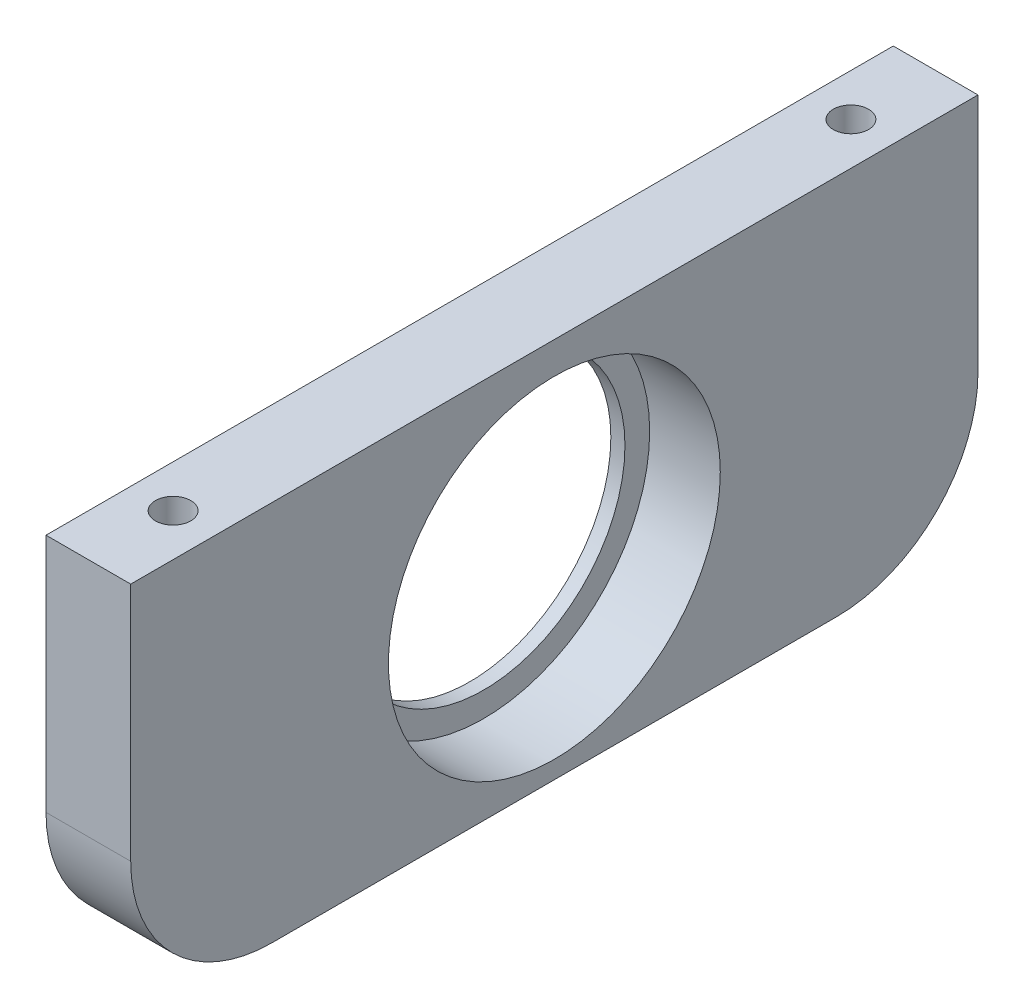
from build123d import *

# Parameters (mm, degrees)
SKETCH4_W                 = 60
SKETCH4_H                 = 27
BOSS_EXTRUDE2_DEPTH       = 6
SKETCH5_R                 = 11.75
CUT_EXTRUDE3_DEPTH        = 5
SKETCH6_R                 = 10
CUT_EXTRUDE4_DEPTH        = 34.481338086
FILLET1_R                 = 10
M3X0_5_TAPPED_HOLE1_D     = 2.5
M3X0_5_TAPPED_HOLE1_DEPTH = 7.5
M3X0_5_TAPPED_HOLE1_TIP   = 0.751075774


with BuildPart() as part:
    # Sketch4 → Boss-Extrude2 (new body)
    with BuildSketch(Plane(origin=(0, 0, 0), x_dir=(0, 0, -1), z_dir=(1, 0, 0))):
        with Locations((0, 0.5)):
            Rectangle(SKETCH4_W, SKETCH4_H)
    extrude(amount=BOSS_EXTRUDE2_DEPTH)

    # Sketch5 → Cut-Extrude3 (cut)
    with BuildSketch(Plane(origin=(6, 0, 0), x_dir=(0, 0, -1), z_dir=(1, 0, 0))):
        Circle(SKETCH5_R)
    extrude(amount=-CUT_EXTRUDE3_DEPTH, mode=Mode.SUBTRACT)

    # Sketch6 → Cut-Extrude4 (cut, through all)
    with BuildSketch(Plane(origin=(1, 0, 0), x_dir=(0, 0, -1), z_dir=(1, 0, 0))):
        Circle(SKETCH6_R)
    extrude(amount=-CUT_EXTRUDE4_DEPTH, mode=Mode.SUBTRACT)

    # Fillet1
    fillet1_edges = [part.edges().sort_by_distance(p)[0] for p in [
        (3, -13, -30),
        (3, -13, 30),
    ]]
    fillet(fillet1_edges, radius=FILLET1_R)

    # M3x0.5 Tapped Hole1
    with Locations(Plane(origin=(0, 14, 0), x_dir=(1, 0, 0), z_dir=(0, 1, 0))):
        with Locations((3, 24), (3, -24)):
            Hole(M3X0_5_TAPPED_HOLE1_D / 2, depth=M3X0_5_TAPPED_HOLE1_DEPTH)
            with Locations((0, 0, -(M3X0_5_TAPPED_HOLE1_DEPTH + M3X0_5_TAPPED_HOLE1_TIP / 2))):  # 118° drill point
                Cone(0, M3X0_5_TAPPED_HOLE1_D / 2, M3X0_5_TAPPED_HOLE1_TIP, mode=Mode.SUBTRACT)


solid = part.part
